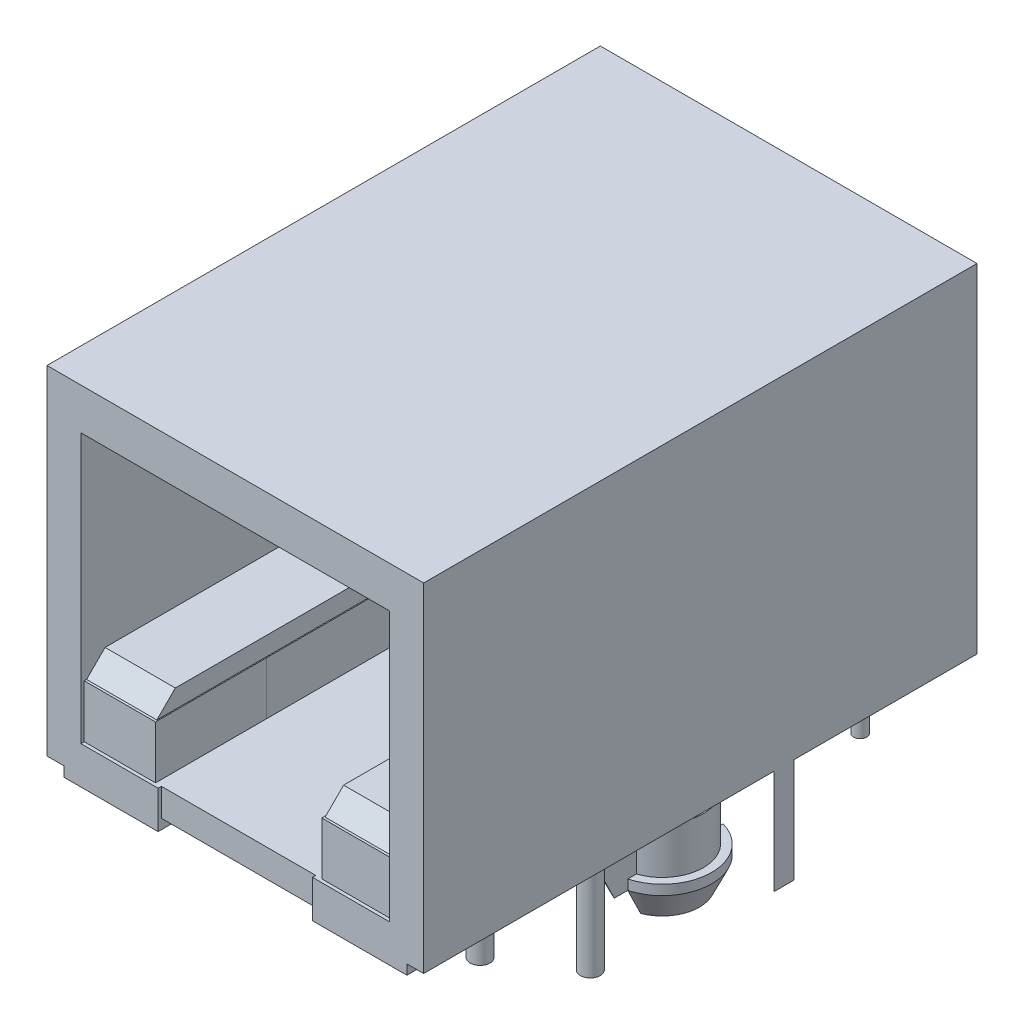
from build123d import *
from OCP.BRepFilletAPI import BRepFilletAPI_MakeChamfer

# Parameters (mm, degrees)
SKETCH1_W          = 21.3
SKETCH1_H          = 13.02
EXTRUDE1_DEPTH     = 7.25
CUT_EXTRUDE1_DEPTH = 0.127
CUT_EXTRUDE2_DEPTH = 11.303
EXTRUDE2_DEPTH     = 3.79984
CUT_EXTRUDE3_START = -11.43
SKETCH5_W          = 0.44704
SKETCH5_H          = 3.302
CUT_EXTRUDE3_DEPTH = 8.89
EXTRUDE3_DEPTH     = 2.7051
EXTRUDE4_DEPTH     = 0.381
SKETCH13_R         = 1.5875
EXTRUDE5_DEPTH     = 1.8034
SKETCH17_R         = 1.905
EXTRUDE6_DEPTH     = 1.397
CHAMFER1_SIZE      = 1.016
CHAMFER1_SIZE2     = 0.473768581
CUT_EXTRUDE4_REACH = 29.836
SKETCH19_W         = 1.016
SKETCH19_H         = 5.08
SKETCH20_R         = 0.381
EXTRUDE7_DEPTH     = 4.0132
SKETCH21_R         = 0.254
EXTRUDE8_DEPTH     = 3.2004


with BuildPart() as part:
    # Sketch1 → Extrude1 (new, symmetric)
    with BuildSketch(Plane(origin=(0, 0, 0), x_dir=(0, 0, -1), z_dir=(1, 0, 0))):
        with Locations((-10.65, 6.51)):
            Rectangle(SKETCH1_W, SKETCH1_H)
    extrude(amount=EXTRUDE1_DEPTH, both=True)

    # Sketch2 → Cut-Extrude1 (cut)
    with BuildSketch(Plane.XY.offset(21.3)):
        Polygon((-5.9436, 11.43), (5.9436, 11.43), (5.9436, 1.0668), (2.9718, 1.0668), (2.9718, 0), (-2.9718, 0), (-2.9718, 1.0668), (-5.9436, 1.0668), align=None)
    extrude(amount=-CUT_EXTRUDE1_DEPTH, mode=Mode.SUBTRACT)

    # Sketch3 → Cut-Extrude2 (cut)
    with BuildSketch(Plane.XY.offset(21.173)):
        Polygon((-5.9436, 3.0988), (-3.2004, 3.0988), (-3.2004, 1.0668), (3.2004, 1.0668), (3.2004, 3.0988), (5.9436, 3.0988), (5.9436, 11.43), (-5.9436, 11.43), align=None)
    extrude(amount=-CUT_EXTRUDE2_DEPTH, mode=Mode.SUBTRACT)

    # Sketch4 → Extrude2 (add, symmetric)
    with BuildSketch(Plane(origin=(0, 0, 0), x_dir=(0, 0, -1), z_dir=(1, 0, 0))):
        Polygon((-17.592809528, 11.43), (-18.76, 11.43), (-9.87, 8.128), (-9.87, 8.56152789), align=None)
    extrude(amount=EXTRUDE2_DEPTH, both=True)

    # Sketch5 → Cut-Extrude3 (cut)
    with BuildSketch(Plane.XY.offset(21.3).offset(CUT_EXTRUDE3_START)):
        with Locations((-3.12928, 9.779)):
            Rectangle(SKETCH5_W, SKETCH5_H)
        with Locations((-2.2352, 9.779)):
            Rectangle(SKETCH5_W, SKETCH5_H)
        with Locations((-1.34112, 9.779)):
            Rectangle(SKETCH5_W, SKETCH5_H)
        with Locations((-0.44704, 9.779)):
            Rectangle(SKETCH5_W, SKETCH5_H)
        with Locations((0.44704, 9.779)):
            Rectangle(SKETCH5_W, SKETCH5_H)
        with Locations((1.34112, 9.779)):
            Rectangle(SKETCH5_W, SKETCH5_H)
        with Locations((2.2352, 9.779)):
            Rectangle(SKETCH5_W, SKETCH5_H)
        with Locations((3.12928, 9.779)):
            Rectangle(SKETCH5_W, SKETCH5_H)
    extrude(amount=CUT_EXTRUDE3_DEPTH, mode=Mode.SUBTRACT)

    # Sketch6 → Extrude3 (add)
    with BuildSketch(Plane(origin=(-5.9436, 0, 0), x_dir=(0, 0, -1), z_dir=(1, 0, 0))):
        Polygon((-9.87, 3.0988), (-21.082, 3.0988), (-20.3708, 3.81), (-12.446, 3.81), (-12.446, 4.826), (-9.87, 4.826), align=None)
    extrude3 = extrude(amount=EXTRUDE3_DEPTH)

    # Mirror1: Extrude3 across plane
    add(extrude3.mirror(Plane(origin=(0, 0, 0), x_dir=(0, 0, 1), z_dir=(1, 0, 0))))

    # Sketch14 → Extrude4 (add)
    with BuildSketch(Plane.XZ):
        Polygon((-6.604, 21.3), (-2.9718, 21.3), (-2.9718, 20.792), (2.9718, 20.792), (2.9718, 21.3), (6.604, 21.3), (6.604, 18.252), (-6.604, 18.252), align=None)
    extrude(amount=EXTRUDE4_DEPTH)

    # Sketch13 → Extrude5 (add)
    with BuildSketch(Plane.XZ):
        with Locations(Location((-5.715, 10.5812, 0), (0, 0, 139.770585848))):
            Circle(SKETCH13_R)
        with Locations(Location((5.715, 10.5812, 0), (0, 0, 40.229414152))):
            Circle(SKETCH13_R)
    extrude(amount=EXTRUDE5_DEPTH)

    # Sketch17 → Extrude6 (add)
    with BuildSketch(Plane.XZ.offset(1.8034)):
        with Locations(Location((5.715, 10.5812, 0), (0, 0, 270))):
            Circle(SKETCH17_R)
        with Locations(Location((-5.715, 10.5812, 0), (0, 0, 270))):
            Circle(SKETCH17_R)
    extrude(amount=EXTRUDE6_DEPTH)

    # Chamfer1: one chamfer whose edges measure the first distance from different faces: ONE call of the kernel's chamfer builder (chamfer() names one face for all edges)
    chamfer1_edges_1 = [part.edges().sort_by_distance(p)[0] for p in [
        (5.715, -3.2004, 12.4862),
    ]]
    chamfer1_side_1 = [part.faces().sort_by_distance(p)[0] for p in [
        (5.715, -2.5019, 12.4862),
    ]]
    chamfer1_edges_2 = [part.edges().sort_by_distance(p)[0] for p in [
        (-5.715, -3.2004, 12.4862),
    ]]
    chamfer1_side_2 = [part.faces().sort_by_distance(p)[0] for p in [
        (-5.715, -2.5019, 12.4862),
    ]]
    chamfer1 = BRepFilletAPI_MakeChamfer(part.part.solid().wrapped)
    for e in chamfer1_edges_1:
        chamfer1.Add(CHAMFER1_SIZE, CHAMFER1_SIZE2, e.wrapped, chamfer1_side_1[0].wrapped)  # the first distance lies on this face
    for e in chamfer1_edges_2:
        chamfer1.Add(CHAMFER1_SIZE, CHAMFER1_SIZE2, e.wrapped, chamfer1_side_2[0].wrapped)  # the first distance lies on this face
    add(Compound.cast(chamfer1.Shape()), mode=Mode.REPLACE)

    # Cut-Extrude4: up to this face of the body (flat: up to its plane)
    cut_extrude4_end = Plane(part.part.faces().sort_by_distance((0, 0, 9.201075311))[0])
    # Sketch19 → Cut-Extrude4 (cut, up to the picked face)
    with BuildSketch(Plane.XZ.offset(3.2004), mode=Mode.PRIVATE) as cut_extrude4_sk1:
        with Locations((5.715, 10.5812)):
            Rectangle(SKETCH19_W, SKETCH19_H)
    cut_extrude4_tool1 = split(extrude(cut_extrude4_sk1.sketch, amount=-CUT_EXTRUDE4_REACH, mode=Mode.PRIVATE), bisect_by=cut_extrude4_end, keep=Keep.BOTH, mode=Mode.PRIVATE)
    # Sketch19 → Cut-Extrude4 (cut, up to the picked face)
    with BuildSketch(Plane.XZ.offset(3.2004), mode=Mode.PRIVATE) as cut_extrude4_sk2:
        with Locations((-5.715, 10.5812)):
            Rectangle(SKETCH19_W, SKETCH19_H)
    cut_extrude4_tool2 = split(extrude(cut_extrude4_sk2.sketch, amount=-CUT_EXTRUDE4_REACH, mode=Mode.PRIVATE), bisect_by=cut_extrude4_end, keep=Keep.BOTH, mode=Mode.PRIVATE)
    add(cut_extrude4_tool1.solids().sort_by(Axis((5.715, -3.2004, 10.5812), (0, 1, 0)))[0], mode=Mode.SUBTRACT)
    add(cut_extrude4_tool2.solids().sort_by(Axis((-5.715, -3.2004, 10.5812), (0, 1, 0)))[0], mode=Mode.SUBTRACT)

    # Sketch20 → Extrude7 (add)
    with BuildSketch(Plane.XZ):
        with Locations(Location((-3.7846, 13.9594, 0), (0, 0, 90))):
            Circle(SKETCH20_R)
        with Locations(Location((6.3246, 13.9594, 0), (0, 0, 90))):
            Circle(SKETCH20_R)
        with Locations(Location((3.7846, 15.6612, 0), (0, 0, 90))):
            Circle(SKETCH20_R)
        with Locations(Location((-6.3246, 15.6612, 0), (0, 0, 90))):
            Circle(SKETCH20_R)
        with BuildLine():
            Line((7.25, 7.047392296), (7.25, 7.815807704))
            ThreePointArc((7.25, 7.815807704), (7.0866, 7.4316), (7.25, 7.047392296))
        make_face()
        with BuildLine():
            Line((-7.25, 7.047392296), (-7.25, 7.815807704))
            ThreePointArc((-7.25, 7.815807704), (-7.0866, 7.4316), (-7.25, 7.047392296))
        make_face()
    extrude(amount=EXTRUDE7_DEPTH)

    # Sketch21 → Extrude8 (add)
    with BuildSketch(Plane.XZ):
        with Locations(Location((3.175, 4.2312, 0), (0, 0, 90))):
            Circle(SKETCH21_R)
        with Locations(Location((0.635, 4.2312, 0), (0, 0, 90))):
            Circle(SKETCH21_R)
        with Locations(Location((-1.905, 4.2312, 0), (0, 0, 90))):
            Circle(SKETCH21_R)
        with Locations(Location((-4.445, 4.2312, 0), (0, 0, 90))):
            Circle(SKETCH21_R)
        with Locations(Location((-3.175, 1.6912, 0), (0, 0, 90))):
            Circle(SKETCH21_R)
        with Locations(Location((-0.635, 1.6912, 0), (0, 0, 90))):
            Circle(SKETCH21_R)
        with Locations(Location((1.905, 1.6912, 0), (0, 0, 90))):
            Circle(SKETCH21_R)
        with Locations(Location((4.445, 1.6912, 0), (0, 0, 90))):
            Circle(SKETCH21_R)
    extrude(amount=EXTRUDE8_DEPTH)


solid = part.part
